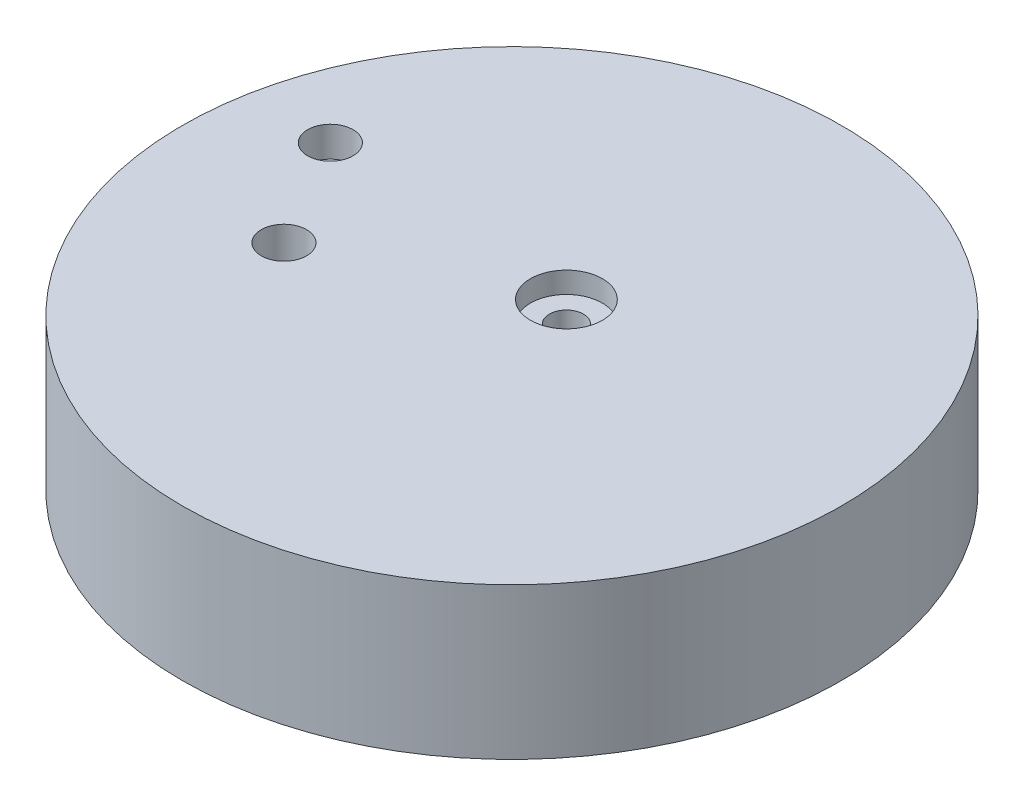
ISO-10303-21;
HEADER;
FILE_DESCRIPTION(('STEP AP214'),'2;1');
FILE_NAME('part.step','',(''),(''),'','','');
FILE_SCHEMA(('AUTOMOTIVE_DESIGN { 1 0 10303 214 1 1 1 1 }'));
ENDSEC;
DATA;
#1=APPLICATION_CONTEXT('core data for automotive mechanical design processes');
#2=APPLICATION_PROTOCOL_DEFINITION('international standard','automotive_design',2000,#1);
#3=PRODUCT_CONTEXT('',#1,'mechanical');
#4=PRODUCT('Part','Part','',(#3));
#5=PRODUCT_RELATED_PRODUCT_CATEGORY('part','',(#4));
#6=PRODUCT_DEFINITION_FORMATION('','',#4);
#7=PRODUCT_DEFINITION_CONTEXT('part definition',#1,'design');
#8=PRODUCT_DEFINITION('design','',#6,#7);
#9=PRODUCT_DEFINITION_SHAPE('','',#8);
#10=(LENGTH_UNIT() NAMED_UNIT(*) SI_UNIT(.MILLI.,.METRE.));
#11=(NAMED_UNIT(*) PLANE_ANGLE_UNIT() SI_UNIT($,.RADIAN.));
#12=(NAMED_UNIT(*) SI_UNIT($,.STERADIAN.) SOLID_ANGLE_UNIT());
#13=UNCERTAINTY_MEASURE_WITH_UNIT(LENGTH_MEASURE(1.E-05),#10,'distance_accuracy_value','');
#14=(GEOMETRIC_REPRESENTATION_CONTEXT(3) GLOBAL_UNCERTAINTY_ASSIGNED_CONTEXT((#13)) GLOBAL_UNIT_ASSIGNED_CONTEXT((#10,
#11,#12)) REPRESENTATION_CONTEXT('',''));
#15=CARTESIAN_POINT('',(0.,0.,0.));
#16=DIRECTION('',(0.,0.,1.));
#17=DIRECTION('',(1.,0.,0.));
#18=AXIS2_PLACEMENT_3D('',#15,#16,#17);
#19=CARTESIAN_POINT('',(0.,30.,0.));
#20=DIRECTION('',(0.,-1.,0.));
#21=DIRECTION('',(0.,0.,-1.));
#22=AXIS2_PLACEMENT_3D('',#19,#20,#21);
#23=CYLINDRICAL_SURFACE('',#22,65.3547992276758);
#24=CARTESIAN_POINT('',(0.,30.,0.));
#25=DIRECTION('',(0.,1.,0.));
#26=DIRECTION('',(0.,0.,1.));
#27=AXIS2_PLACEMENT_3D('',#24,#25,#26);
#28=CIRCLE('',#27,65.3547992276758);
#29=CARTESIAN_POINT('',(0.,30.,65.3547992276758));
#30=VERTEX_POINT('',#29);
#31=EDGE_CURVE('E11',#30,#30,#28,.T.);
#32=ORIENTED_EDGE('',*,*,#31,.F.);
#33=EDGE_LOOP('',(#32));
#34=FACE_BOUND('',#33,.T.);
#35=CARTESIAN_POINT('',(0.,0.,0.));
#36=DIRECTION('',(0.,1.,0.));
#37=DIRECTION('',(0.,0.,1.));
#38=AXIS2_PLACEMENT_3D('',#35,#36,#37);
#39=CIRCLE('',#38,65.3547992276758);
#40=CARTESIAN_POINT('',(0.,0.,65.3547992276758));
#41=VERTEX_POINT('',#40);
#42=EDGE_CURVE('E40',#41,#41,#39,.T.);
#43=ORIENTED_EDGE('',*,*,#42,.T.);
#44=EDGE_LOOP('',(#43));
#45=FACE_BOUND('',#44,.T.);
#46=ADVANCED_FACE('F37',(#34,#45),#23,.T.);
#47=CARTESIAN_POINT('',(0.,30.,0.));
#48=DIRECTION('',(0.,1.,0.));
#49=DIRECTION('',(0.,0.,1.));
#50=AXIS2_PLACEMENT_3D('',#47,#48,#49);
#51=PLANE('',#50);
#52=CARTESIAN_POINT('',(-35.140034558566,30.,10.0773203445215));
#53=DIRECTION('',(0.,1.,0.));
#54=DIRECTION('',(0.,0.,1.));
#55=AXIS2_PLACEMENT_3D('',#52,#53,#54);
#56=CIRCLE('',#55,4.49999999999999);
#57=CARTESIAN_POINT('',(-35.140034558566,30.,14.5773203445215));
#58=VERTEX_POINT('',#57);
#59=EDGE_CURVE('E61',#58,#58,#56,.T.);
#60=ORIENTED_EDGE('',*,*,#59,.F.);
#61=EDGE_LOOP('',(#60));
#62=FACE_BOUND('',#61,.T.);
#63=CARTESIAN_POINT('',(-47.7064281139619,30.,-11.6976897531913));
#64=DIRECTION('',(0.,1.,0.));
#65=DIRECTION('',(0.,0.,1.));
#66=AXIS2_PLACEMENT_3D('',#63,#64,#65);
#67=CIRCLE('',#66,4.5);
#68=CARTESIAN_POINT('',(-47.7064281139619,30.,-7.19768975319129));
#69=VERTEX_POINT('',#68);
#70=EDGE_CURVE('E60',#69,#69,#67,.T.);
#71=ORIENTED_EDGE('',*,*,#70,.F.);
#72=EDGE_LOOP('',(#71));
#73=FACE_BOUND('',#72,.T.);
#74=CARTESIAN_POINT('',(2.61752748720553,30.,-8.18513352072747));
#75=DIRECTION('',(0.,1.,0.));
#76=DIRECTION('',(0.,0.,1.));
#77=AXIS2_PLACEMENT_3D('',#74,#75,#76);
#78=CIRCLE('',#77,7.14375);
#79=CARTESIAN_POINT('',(2.61752748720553,30.,-1.04138352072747));
#80=VERTEX_POINT('',#79);
#81=EDGE_CURVE('E71',#80,#80,#78,.T.);
#82=ORIENTED_EDGE('',*,*,#81,.F.);
#83=EDGE_LOOP('',(#82));
#84=FACE_BOUND('',#83,.T.);
#85=ORIENTED_EDGE('',*,*,#31,.T.);
#86=EDGE_LOOP('',(#85));
#87=FACE_BOUND('',#86,.T.);
#88=ADVANCED_FACE('F91',(#62,#73,#84,#87),#51,.T.);
#89=CARTESIAN_POINT('',(0.,0.,0.));
#90=DIRECTION('',(0.,1.,0.));
#91=DIRECTION('',(0.,0.,1.));
#92=AXIS2_PLACEMENT_3D('',#89,#90,#91);
#93=PLANE('',#92);
#94=CARTESIAN_POINT('',(2.61752748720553,0.,-8.18513352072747));
#95=DIRECTION('',(0.,1.,0.));
#96=DIRECTION('',(0.,0.,1.));
#97=AXIS2_PLACEMENT_3D('',#94,#95,#96);
#98=CIRCLE('',#97,3.37819999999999);
#99=CARTESIAN_POINT('',(2.61752748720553,0.,-4.80693352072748));
#100=VERTEX_POINT('',#99);
#101=EDGE_CURVE('E80',#100,#100,#98,.T.);
#102=ORIENTED_EDGE('',*,*,#101,.T.);
#103=EDGE_LOOP('',(#102));
#104=FACE_BOUND('',#103,.T.);
#105=ORIENTED_EDGE('',*,*,#42,.F.);
#106=EDGE_LOOP('',(#105));
#107=FACE_BOUND('',#106,.T.);
#108=ADVANCED_FACE('F88',(#104,#107),#93,.F.);
#109=CARTESIAN_POINT('',(2.61752748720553,30.,-8.18513352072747));
#110=DIRECTION('',(0.,1.,0.));
#111=DIRECTION('',(0.,0.,1.));
#112=AXIS2_PLACEMENT_3D('',#109,#110,#111);
#113=CYLINDRICAL_SURFACE('',#112,3.3782);
#114=ORIENTED_EDGE('',*,*,#101,.F.);
#115=EDGE_LOOP('',(#114));
#116=FACE_BOUND('',#115,.T.);
#117=CARTESIAN_POINT('',(2.61752748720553,25.809,-8.18513352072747));
#118=DIRECTION('',(0.,1.,0.));
#119=DIRECTION('',(0.,0.,1.));
#120=AXIS2_PLACEMENT_3D('',#117,#118,#119);
#121=CIRCLE('',#120,3.3782);
#122=CARTESIAN_POINT('',(2.61752748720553,25.809,-4.80693352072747));
#123=VERTEX_POINT('',#122);
#124=EDGE_CURVE('E77',#123,#123,#121,.T.);
#125=ORIENTED_EDGE('',*,*,#124,.T.);
#126=EDGE_LOOP('',(#125));
#127=FACE_BOUND('',#126,.T.);
#128=ADVANCED_FACE('F90',(#116,#127),#113,.F.);
#129=CARTESIAN_POINT('',(5.99572748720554,25.809,-8.18513352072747));
#130=DIRECTION('',(0.,-1.,0.));
#131=DIRECTION('',(0.,0.,-1.));
#132=AXIS2_PLACEMENT_3D('',#129,#130,#131);
#133=PLANE('',#132);
#134=ORIENTED_EDGE('',*,*,#124,.F.);
#135=EDGE_LOOP('',(#134));
#136=FACE_BOUND('',#135,.T.);
#137=CARTESIAN_POINT('',(2.61752748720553,25.809,-8.18513352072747));
#138=DIRECTION('',(0.,1.,0.));
#139=DIRECTION('',(0.,0.,1.));
#140=AXIS2_PLACEMENT_3D('',#137,#138,#139);
#141=CIRCLE('',#140,7.14375);
#142=CARTESIAN_POINT('',(2.61752748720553,25.809,-1.04138352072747));
#143=VERTEX_POINT('',#142);
#144=EDGE_CURVE('E74',#143,#143,#141,.T.);
#145=ORIENTED_EDGE('',*,*,#144,.T.);
#146=EDGE_LOOP('',(#145));
#147=FACE_BOUND('',#146,.T.);
#148=ADVANCED_FACE('F96',(#136,#147),#133,.F.);
#149=CARTESIAN_POINT('',(2.61752748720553,30.,-8.18513352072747));
#150=DIRECTION('',(0.,1.,0.));
#151=DIRECTION('',(0.,0.,1.));
#152=AXIS2_PLACEMENT_3D('',#149,#150,#151);
#153=CYLINDRICAL_SURFACE('',#152,7.14375);
#154=ORIENTED_EDGE('',*,*,#144,.F.);
#155=EDGE_LOOP('',(#154));
#156=FACE_BOUND('',#155,.T.);
#157=ORIENTED_EDGE('',*,*,#81,.T.);
#158=EDGE_LOOP('',(#157));
#159=FACE_BOUND('',#158,.T.);
#160=ADVANCED_FACE('F158',(#156,#159),#153,.F.);
#161=CARTESIAN_POINT('',(-47.7064281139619,24.,-11.6976897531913));
#162=DIRECTION('',(0.,1.,0.));
#163=DIRECTION('',(0.,0.,1.));
#164=AXIS2_PLACEMENT_3D('',#161,#162,#163);
#165=CONICAL_SURFACE('',#164,4.5,1.02974425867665);
#166=CARTESIAN_POINT('',(-47.7064281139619,21.296127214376,-11.6976897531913));
#167=VERTEX_POINT('',#166);
#168=VERTEX_LOOP('',#167);
#169=FACE_BOUND('',#168,.T.);
#170=CARTESIAN_POINT('',(-47.7064281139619,24.,-11.6976897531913));
#171=DIRECTION('',(0.,1.,0.));
#172=DIRECTION('',(0.,0.,1.));
#173=AXIS2_PLACEMENT_3D('',#170,#171,#172);
#174=CIRCLE('',#173,4.5);
#175=CARTESIAN_POINT('',(-47.7064281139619,24.,-7.1976897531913));
#176=VERTEX_POINT('',#175);
#177=EDGE_CURVE('E64',#176,#176,#174,.T.);
#178=ORIENTED_EDGE('',*,*,#177,.T.);
#179=EDGE_LOOP('',(#178));
#180=FACE_BOUND('',#179,.T.);
#181=ADVANCED_FACE('F142',(#169,#180),#165,.F.);
#182=CARTESIAN_POINT('',(-47.7064281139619,30.,-11.6976897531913));
#183=DIRECTION('',(0.,1.,0.));
#184=DIRECTION('',(0.,0.,1.));
#185=AXIS2_PLACEMENT_3D('',#182,#183,#184);
#186=CYLINDRICAL_SURFACE('',#185,4.5);
#187=ORIENTED_EDGE('',*,*,#177,.F.);
#188=EDGE_LOOP('',(#187));
#189=FACE_BOUND('',#188,.T.);
#190=ORIENTED_EDGE('',*,*,#70,.T.);
#191=EDGE_LOOP('',(#190));
#192=FACE_BOUND('',#191,.T.);
#193=ADVANCED_FACE('F54',(#189,#192),#186,.F.);
#194=CARTESIAN_POINT('',(-35.140034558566,7.,10.0773203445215));
#195=DIRECTION('',(0.,1.,0.));
#196=DIRECTION('',(0.,0.,1.));
#197=AXIS2_PLACEMENT_3D('',#194,#195,#196);
#198=CONICAL_SURFACE('',#197,4.5,1.02974425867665);
#199=CARTESIAN_POINT('',(-35.140034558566,4.29612721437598,10.0773203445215));
#200=VERTEX_POINT('',#199);
#201=VERTEX_LOOP('',#200);
#202=FACE_BOUND('',#201,.T.);
#203=CARTESIAN_POINT('',(-35.140034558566,7.,10.0773203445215));
#204=DIRECTION('',(0.,1.,0.));
#205=DIRECTION('',(0.,0.,1.));
#206=AXIS2_PLACEMENT_3D('',#203,#204,#205);
#207=CIRCLE('',#206,4.5);
#208=CARTESIAN_POINT('',(-35.140034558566,7.,14.5773203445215));
#209=VERTEX_POINT('',#208);
#210=EDGE_CURVE('E58',#209,#209,#207,.T.);
#211=ORIENTED_EDGE('',*,*,#210,.T.);
#212=EDGE_LOOP('',(#211));
#213=FACE_BOUND('',#212,.T.);
#214=ADVANCED_FACE('F50',(#202,#213),#198,.F.);
#215=CARTESIAN_POINT('',(-35.140034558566,30.,10.0773203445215));
#216=DIRECTION('',(0.,1.,0.));
#217=DIRECTION('',(0.,0.,1.));
#218=AXIS2_PLACEMENT_3D('',#215,#216,#217);
#219=CYLINDRICAL_SURFACE('',#218,4.49999999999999);
#220=ORIENTED_EDGE('',*,*,#210,.F.);
#221=EDGE_LOOP('',(#220));
#222=FACE_BOUND('',#221,.T.);
#223=ORIENTED_EDGE('',*,*,#59,.T.);
#224=EDGE_LOOP('',(#223));
#225=FACE_BOUND('',#224,.T.);
#226=ADVANCED_FACE('F53',(#222,#225),#219,.F.);
#227=CLOSED_SHELL('',(#46,#88,#108,#128,#148,#160,#181,#193,#214,#226));
#228=MANIFOLD_SOLID_BREP('B2',#227);
#229=ADVANCED_BREP_SHAPE_REPRESENTATION('',(#18,#228),#14);
#230=SHAPE_DEFINITION_REPRESENTATION(#9,#229);
ENDSEC;
END-ISO-10303-21;
